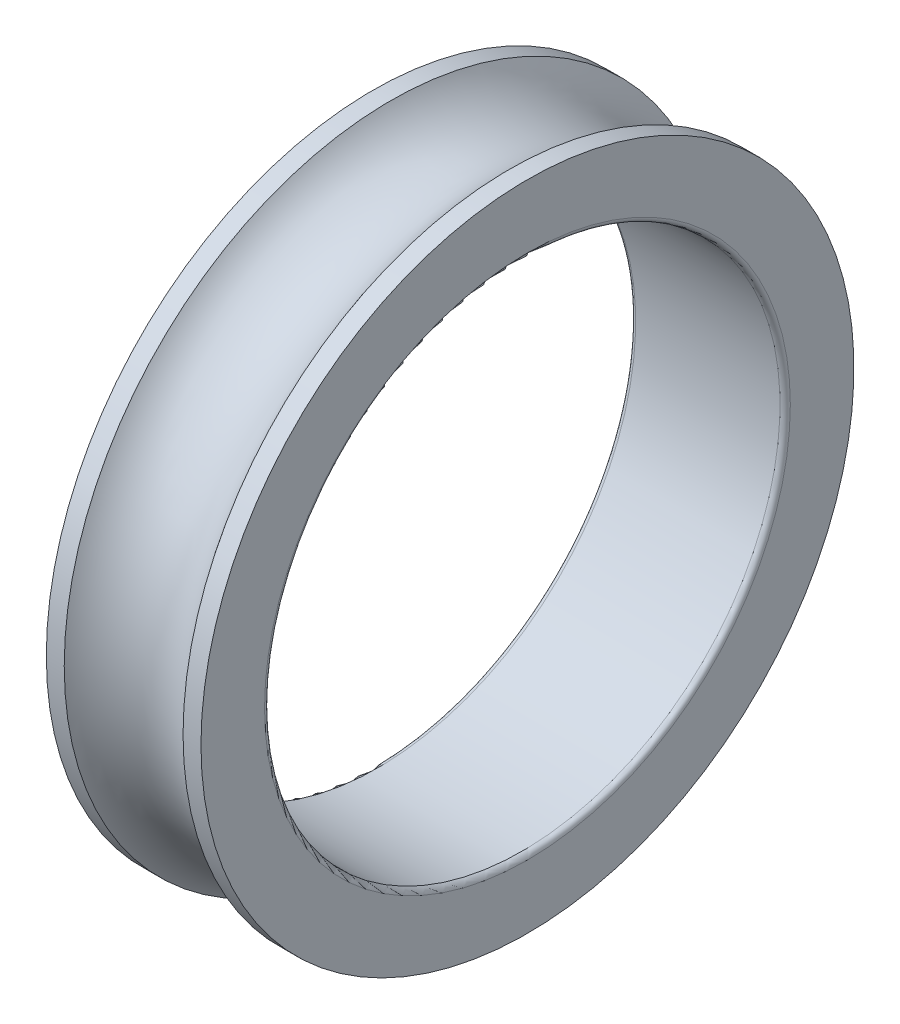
ISO-10303-21;
HEADER;
FILE_DESCRIPTION(('STEP AP214'),'2;1');
FILE_NAME('part.step','',(''),(''),'','','');
FILE_SCHEMA(('AUTOMOTIVE_DESIGN { 1 0 10303 214 1 1 1 1 }'));
ENDSEC;
DATA;
#1=APPLICATION_CONTEXT('core data for automotive mechanical design processes');
#2=APPLICATION_PROTOCOL_DEFINITION('international standard','automotive_design',2000,#1);
#3=PRODUCT_CONTEXT('',#1,'mechanical');
#4=PRODUCT('Part','Part','',(#3));
#5=PRODUCT_RELATED_PRODUCT_CATEGORY('part','',(#4));
#6=PRODUCT_DEFINITION_FORMATION('','',#4);
#7=PRODUCT_DEFINITION_CONTEXT('part definition',#1,'design');
#8=PRODUCT_DEFINITION('design','',#6,#7);
#9=PRODUCT_DEFINITION_SHAPE('','',#8);
#10=(LENGTH_UNIT() NAMED_UNIT(*) SI_UNIT(.MILLI.,.METRE.));
#11=(NAMED_UNIT(*) PLANE_ANGLE_UNIT() SI_UNIT($,.RADIAN.));
#12=(NAMED_UNIT(*) SI_UNIT($,.STERADIAN.) SOLID_ANGLE_UNIT());
#13=UNCERTAINTY_MEASURE_WITH_UNIT(LENGTH_MEASURE(1.E-05),#10,'distance_accuracy_value','');
#14=(GEOMETRIC_REPRESENTATION_CONTEXT(3) GLOBAL_UNCERTAINTY_ASSIGNED_CONTEXT((#13)) GLOBAL_UNIT_ASSIGNED_CONTEXT((#10,
#11,#12)) REPRESENTATION_CONTEXT('',''));
#15=CARTESIAN_POINT('',(0.,0.,0.));
#16=DIRECTION('',(0.,0.,1.));
#17=DIRECTION('',(1.,0.,0.));
#18=AXIS2_PLACEMENT_3D('',#15,#16,#17);
#19=CARTESIAN_POINT('',(0.,0.,0.));
#20=DIRECTION('',(-1.,0.,0.));
#21=DIRECTION('',(0.,0.,1.));
#22=AXIS2_PLACEMENT_3D('',#19,#20,#21);
#23=CYLINDRICAL_SURFACE('',#22,19.);
#24=CARTESIAN_POINT('',(0.,0.,0.));
#25=DIRECTION('',(-1.,0.,0.));
#26=DIRECTION('',(0.,0.,1.));
#27=AXIS2_PLACEMENT_3D('',#24,#25,#26);
#28=CIRCLE('',#27,19.);
#29=CARTESIAN_POINT('',(0.,0.,19.));
#30=VERTEX_POINT('',#29);
#31=EDGE_CURVE('E10',#30,#30,#28,.T.);
#32=ORIENTED_EDGE('',*,*,#31,.F.);
#33=EDGE_LOOP('',(#32));
#34=FACE_BOUND('',#33,.T.);
#35=CARTESIAN_POINT('',(1.04232938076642,0.,0.));
#36=DIRECTION('',(-1.,0.,0.));
#37=DIRECTION('',(0.,0.,1.));
#38=AXIS2_PLACEMENT_3D('',#35,#36,#37);
#39=CIRCLE('',#38,19.);
#40=CARTESIAN_POINT('',(1.04232938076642,0.,19.));
#41=VERTEX_POINT('',#40);
#42=EDGE_CURVE('E42',#41,#41,#39,.T.);
#43=ORIENTED_EDGE('',*,*,#42,.T.);
#44=EDGE_LOOP('',(#43));
#45=FACE_BOUND('',#44,.T.);
#46=ADVANCED_FACE('F14',(#34,#45),#23,.T.);
#47=CARTESIAN_POINT('',(0.,19.,0.));
#48=DIRECTION('',(1.,0.,0.));
#49=DIRECTION('',(0.,0.,-1.));
#50=AXIS2_PLACEMENT_3D('',#47,#48,#49);
#51=PLANE('',#50);
#52=CARTESIAN_POINT('',(0.,0.,0.));
#53=DIRECTION('',(-1.,0.,0.));
#54=DIRECTION('',(0.,0.,1.));
#55=AXIS2_PLACEMENT_3D('',#52,#53,#54);
#56=CIRCLE('',#55,15.3);
#57=CARTESIAN_POINT('',(0.,0.,15.3));
#58=VERTEX_POINT('',#57);
#59=EDGE_CURVE('E20',#58,#58,#56,.T.);
#60=ORIENTED_EDGE('',*,*,#59,.F.);
#61=EDGE_LOOP('',(#60));
#62=FACE_BOUND('',#61,.T.);
#63=ORIENTED_EDGE('',*,*,#31,.T.);
#64=EDGE_LOOP('',(#63));
#65=FACE_BOUND('',#64,.T.);
#66=ADVANCED_FACE('F60',(#62,#65),#51,.F.);
#67=CARTESIAN_POINT('',(0.3,0.,0.));
#68=DIRECTION('',(-1.,0.,0.));
#69=DIRECTION('',(0.,0.,1.));
#70=AXIS2_PLACEMENT_3D('',#67,#68,#69);
#71=TOROIDAL_SURFACE('',#70,15.3,0.3);
#72=CARTESIAN_POINT('',(0.3,0.,0.));
#73=DIRECTION('',(-1.,0.,0.));
#74=DIRECTION('',(0.,0.,1.));
#75=AXIS2_PLACEMENT_3D('',#72,#73,#74);
#76=CIRCLE('',#75,15.);
#77=CARTESIAN_POINT('',(0.3,0.,15.));
#78=VERTEX_POINT('',#77);
#79=EDGE_CURVE('E24',#78,#78,#76,.T.);
#80=ORIENTED_EDGE('',*,*,#79,.F.);
#81=EDGE_LOOP('',(#80));
#82=FACE_BOUND('',#81,.T.);
#83=ORIENTED_EDGE('',*,*,#59,.T.);
#84=EDGE_LOOP('',(#83));
#85=FACE_BOUND('',#84,.T.);
#86=ADVANCED_FACE('F65',(#82,#85),#71,.T.);
#87=CARTESIAN_POINT('',(0.,0.,0.));
#88=DIRECTION('',(-1.,0.,0.));
#89=DIRECTION('',(0.,0.,1.));
#90=AXIS2_PLACEMENT_3D('',#87,#88,#89);
#91=CYLINDRICAL_SURFACE('',#90,15.);
#92=CARTESIAN_POINT('',(8.7,0.,0.));
#93=DIRECTION('',(-1.,0.,0.));
#94=DIRECTION('',(0.,0.,1.));
#95=AXIS2_PLACEMENT_3D('',#92,#93,#94);
#96=CIRCLE('',#95,15.);
#97=CARTESIAN_POINT('',(8.7,0.,15.));
#98=VERTEX_POINT('',#97);
#99=EDGE_CURVE('E28',#98,#98,#96,.T.);
#100=ORIENTED_EDGE('',*,*,#99,.F.);
#101=EDGE_LOOP('',(#100));
#102=FACE_BOUND('',#101,.T.);
#103=ORIENTED_EDGE('',*,*,#79,.T.);
#104=EDGE_LOOP('',(#103));
#105=FACE_BOUND('',#104,.T.);
#106=ADVANCED_FACE('F70',(#102,#105),#91,.F.);
#107=CARTESIAN_POINT('',(8.7,0.,0.));
#108=DIRECTION('',(-1.,0.,0.));
#109=DIRECTION('',(0.,0.,1.));
#110=AXIS2_PLACEMENT_3D('',#107,#108,#109);
#111=TOROIDAL_SURFACE('',#110,15.3,0.3);
#112=CARTESIAN_POINT('',(9.,0.,0.));
#113=DIRECTION('',(-1.,0.,0.));
#114=DIRECTION('',(0.,0.,1.));
#115=AXIS2_PLACEMENT_3D('',#112,#113,#114);
#116=CIRCLE('',#115,15.3);
#117=CARTESIAN_POINT('',(9.,0.,15.3));
#118=VERTEX_POINT('',#117);
#119=EDGE_CURVE('E33',#118,#118,#116,.T.);
#120=ORIENTED_EDGE('',*,*,#119,.F.);
#121=EDGE_LOOP('',(#120));
#122=FACE_BOUND('',#121,.T.);
#123=ORIENTED_EDGE('',*,*,#99,.T.);
#124=EDGE_LOOP('',(#123));
#125=FACE_BOUND('',#124,.T.);
#126=ADVANCED_FACE('F76',(#122,#125),#111,.T.);
#127=CARTESIAN_POINT('',(9.,15.3,0.));
#128=DIRECTION('',(-1.,0.,0.));
#129=DIRECTION('',(0.,0.,1.));
#130=AXIS2_PLACEMENT_3D('',#127,#128,#129);
#131=PLANE('',#130);
#132=CARTESIAN_POINT('',(9.,0.,0.));
#133=DIRECTION('',(-1.,0.,0.));
#134=DIRECTION('',(0.,0.,1.));
#135=AXIS2_PLACEMENT_3D('',#132,#133,#134);
#136=CIRCLE('',#135,19.);
#137=CARTESIAN_POINT('',(9.,0.,19.));
#138=VERTEX_POINT('',#137);
#139=EDGE_CURVE('E36',#138,#138,#136,.T.);
#140=ORIENTED_EDGE('',*,*,#139,.F.);
#141=EDGE_LOOP('',(#140));
#142=FACE_BOUND('',#141,.T.);
#143=ORIENTED_EDGE('',*,*,#119,.T.);
#144=EDGE_LOOP('',(#143));
#145=FACE_BOUND('',#144,.T.);
#146=ADVANCED_FACE('F56',(#142,#145),#131,.F.);
#147=CARTESIAN_POINT('',(0.,0.,0.));
#148=DIRECTION('',(-1.,0.,0.));
#149=DIRECTION('',(0.,0.,1.));
#150=AXIS2_PLACEMENT_3D('',#147,#148,#149);
#151=CYLINDRICAL_SURFACE('',#150,19.);
#152=CARTESIAN_POINT('',(7.95767061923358,0.,0.));
#153=DIRECTION('',(-1.,0.,0.));
#154=DIRECTION('',(0.,0.,1.));
#155=AXIS2_PLACEMENT_3D('',#152,#153,#154);
#156=CIRCLE('',#155,19.);
#157=CARTESIAN_POINT('',(7.95767061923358,0.,19.));
#158=VERTEX_POINT('',#157);
#159=EDGE_CURVE('E39',#158,#158,#156,.T.);
#160=ORIENTED_EDGE('',*,*,#159,.F.);
#161=EDGE_LOOP('',(#160));
#162=FACE_BOUND('',#161,.T.);
#163=ORIENTED_EDGE('',*,*,#139,.T.);
#164=EDGE_LOOP('',(#163));
#165=FACE_BOUND('',#164,.T.);
#166=ADVANCED_FACE('F49',(#162,#165),#151,.T.);
#167=CARTESIAN_POINT('',(4.5,0.,0.));
#168=DIRECTION('',(-1.,0.,0.));
#169=DIRECTION('',(0.,0.,1.));
#170=AXIS2_PLACEMENT_3D('',#167,#168,#169);
#171=TOROIDAL_SURFACE('',#170,21.325,4.16666666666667);
#172=ORIENTED_EDGE('',*,*,#159,.T.);
#173=EDGE_LOOP('',(#172));
#174=FACE_BOUND('',#173,.T.);
#175=ORIENTED_EDGE('',*,*,#42,.F.);
#176=EDGE_LOOP('',(#175));
#177=FACE_BOUND('',#176,.T.);
#178=ADVANCED_FACE('F47',(#174,#177),#171,.F.);
#179=CLOSED_SHELL('',(#46,#66,#86,#106,#126,#146,#166,#178));
#180=MANIFOLD_SOLID_BREP('B1',#179);
#181=ADVANCED_BREP_SHAPE_REPRESENTATION('',(#18,#180),#14);
#182=SHAPE_DEFINITION_REPRESENTATION(#9,#181);
ENDSEC;
END-ISO-10303-21;
